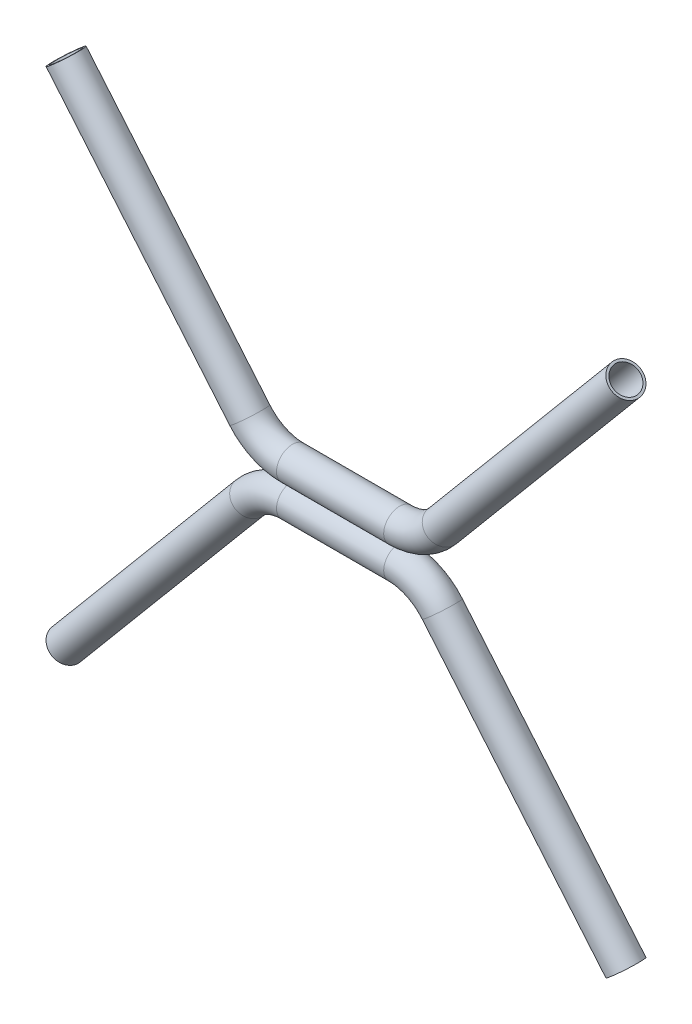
ISO-10303-21;
HEADER;
FILE_DESCRIPTION(('STEP AP214'),'2;1');
FILE_NAME('part.step','',(''),(''),'','','');
FILE_SCHEMA(('AUTOMOTIVE_DESIGN { 1 0 10303 214 1 1 1 1 }'));
ENDSEC;
DATA;
#1=APPLICATION_CONTEXT('core data for automotive mechanical design processes');
#2=APPLICATION_PROTOCOL_DEFINITION('international standard','automotive_design',2000,#1);
#3=PRODUCT_CONTEXT('',#1,'mechanical');
#4=PRODUCT('Part','Part','',(#3));
#5=PRODUCT_RELATED_PRODUCT_CATEGORY('part','',(#4));
#6=PRODUCT_DEFINITION_FORMATION('','',#4);
#7=PRODUCT_DEFINITION_CONTEXT('part definition',#1,'design');
#8=PRODUCT_DEFINITION('design','',#6,#7);
#9=PRODUCT_DEFINITION_SHAPE('','',#8);
#10=(LENGTH_UNIT() NAMED_UNIT(*) SI_UNIT(.MILLI.,.METRE.));
#11=(NAMED_UNIT(*) PLANE_ANGLE_UNIT() SI_UNIT($,.RADIAN.));
#12=(NAMED_UNIT(*) SI_UNIT($,.STERADIAN.) SOLID_ANGLE_UNIT());
#13=UNCERTAINTY_MEASURE_WITH_UNIT(LENGTH_MEASURE(1.E-05),#10,'distance_accuracy_value','');
#14=(GEOMETRIC_REPRESENTATION_CONTEXT(3) GLOBAL_UNCERTAINTY_ASSIGNED_CONTEXT((#13)) GLOBAL_UNIT_ASSIGNED_CONTEXT((#10,
#11,#12)) REPRESENTATION_CONTEXT('',''));
#15=CARTESIAN_POINT('',(0.,0.,0.));
#16=DIRECTION('',(0.,0.,1.));
#17=DIRECTION('',(1.,0.,0.));
#18=AXIS2_PLACEMENT_3D('',#15,#16,#17);
#19=CARTESIAN_POINT('',(33.679231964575,0.,0.));
#20=DIRECTION('',(1.,0.,0.));
#21=DIRECTION('',(0.,1.,0.));
#22=AXIS2_PLACEMENT_3D('',#19,#20,#21);
#23=PLANE('',#22);
#24=CARTESIAN_POINT('',(33.679231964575,10.5353606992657,-3.2311923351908));
#25=DIRECTION('',(0.,-1.,0.));
#26=VECTOR('',#25,1.);
#27=LINE('',#24,#26);
#28=CARTESIAN_POINT('',(33.679231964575,10.5353606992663,-3.23119233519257));
#29=VERTEX_POINT('',#28);
#30=CARTESIAN_POINT('',(33.679231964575,9.4646393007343,-3.2311923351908));
#31=VERTEX_POINT('',#30);
#32=EDGE_CURVE('E104',#29,#31,#27,.T.);
#33=ORIENTED_EDGE('',*,*,#32,.F.);
#34=CARTESIAN_POINT('',(33.679231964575,20.,0.));
#35=DIRECTION('',(1.,0.,0.));
#36=DIRECTION('',(0.,1.,0.));
#37=AXIS2_PLACEMENT_3D('',#34,#35,#36);
#38=CIRCLE('',#37,10.001);
#39=CARTESIAN_POINT('',(33.679231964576,10.,-0.141424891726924));
#40=VERTEX_POINT('',#39);
#41=EDGE_CURVE('E72',#29,#40,#38,.F.);
#42=ORIENTED_EDGE('',*,*,#41,.T.);
#43=CARTESIAN_POINT('',(33.679231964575,0.,0.));
#44=DIRECTION('',(-1.,0.,0.));
#45=DIRECTION('',(0.,-1.,0.));
#46=AXIS2_PLACEMENT_3D('',#43,#44,#45);
#47=CIRCLE('',#46,10.001);
#48=EDGE_CURVE('E97',#31,#40,#47,.F.);
#49=ORIENTED_EDGE('',*,*,#48,.F.);
#50=EDGE_LOOP('',(#33,#42,#49));
#51=FACE_BOUND('',#50,.T.);
#52=ADVANCED_FACE('F47',(#51),#23,.T.);
#53=CARTESIAN_POINT('',(-33.679231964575,20.,0.));
#54=DIRECTION('',(-1.,0.,0.));
#55=DIRECTION('',(0.,-1.,0.));
#56=AXIS2_PLACEMENT_3D('',#53,#54,#55);
#57=PLANE('',#56);
#58=CARTESIAN_POINT('',(-33.679231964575,9.4646393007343,-3.2311923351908));
#59=DIRECTION('',(0.,1.,0.));
#60=VECTOR('',#59,1.);
#61=LINE('',#58,#60);
#62=CARTESIAN_POINT('',(-33.679231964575,9.46463930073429,-3.23119233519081));
#63=VERTEX_POINT('',#62);
#64=CARTESIAN_POINT('',(-33.679231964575,10.5353606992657,-3.2311923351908));
#65=VERTEX_POINT('',#64);
#66=EDGE_CURVE('E92',#63,#65,#61,.T.);
#67=ORIENTED_EDGE('',*,*,#66,.F.);
#68=CARTESIAN_POINT('',(-33.679231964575,0.,0.));
#69=DIRECTION('',(1.,0.,0.));
#70=DIRECTION('',(0.,1.,0.));
#71=AXIS2_PLACEMENT_3D('',#68,#69,#70);
#72=CIRCLE('',#71,10.001);
#73=CARTESIAN_POINT('',(-33.6792319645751,9.99999999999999,-0.141424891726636));
#74=VERTEX_POINT('',#73);
#75=EDGE_CURVE('E64',#63,#74,#72,.T.);
#76=ORIENTED_EDGE('',*,*,#75,.T.);
#77=CARTESIAN_POINT('',(-33.679231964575,20.,0.));
#78=DIRECTION('',(-1.,0.,0.));
#79=DIRECTION('',(0.,-1.,0.));
#80=AXIS2_PLACEMENT_3D('',#77,#78,#79);
#81=CIRCLE('',#80,10.001);
#82=EDGE_CURVE('E85',#65,#74,#81,.T.);
#83=ORIENTED_EDGE('',*,*,#82,.F.);
#84=EDGE_LOOP('',(#67,#76,#83));
#85=FACE_BOUND('',#84,.T.);
#86=ADVANCED_FACE('F49',(#85),#57,.T.);
#87=CARTESIAN_POINT('',(-33.679231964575,10.5353606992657,-3.2311923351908));
#88=DIRECTION('',(0.,0.,-1.));
#89=DIRECTION('',(-1.,0.,0.));
#90=AXIS2_PLACEMENT_3D('',#87,#88,#89);
#91=PLANE('',#90);
#92=ORIENTED_EDGE('',*,*,#32,.T.);
#93=DIRECTION('',(1.,0.,0.));
#94=VECTOR('',#93,1.);
#95=CARTESIAN_POINT('',(-33.679231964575,9.4646393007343,-3.2311923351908));
#96=LINE('',#95,#94);
#97=EDGE_CURVE('E13',#63,#31,#96,.T.);
#98=ORIENTED_EDGE('',*,*,#97,.F.);
#99=ORIENTED_EDGE('',*,*,#66,.T.);
#100=DIRECTION('',(1.,0.,0.));
#101=VECTOR('',#100,1.);
#102=CARTESIAN_POINT('',(-33.679231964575,10.5353606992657,-3.2311923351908));
#103=LINE('',#102,#101);
#104=EDGE_CURVE('E57',#29,#65,#103,.F.);
#105=ORIENTED_EDGE('',*,*,#104,.F.);
#106=EDGE_LOOP('',(#92,#98,#99,#105));
#107=FACE_BOUND('',#106,.T.);
#108=ADVANCED_FACE('F116',(#107),#91,.T.);
#109=CARTESIAN_POINT('',(-33.679231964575,0.,0.));
#110=DIRECTION('',(1.,0.,0.));
#111=DIRECTION('',(0.,1.,0.));
#112=AXIS2_PLACEMENT_3D('',#109,#110,#111);
#113=CYLINDRICAL_SURFACE('',#112,10.001);
#114=ORIENTED_EDGE('',*,*,#48,.T.);
#115=DIRECTION('',(-1.,0.,0.));
#116=VECTOR('',#115,1.);
#117=CARTESIAN_POINT('',(-33.679231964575,10.,-0.141424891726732));
#118=LINE('',#117,#116);
#119=EDGE_CURVE('E87',#40,#74,#118,.T.);
#120=ORIENTED_EDGE('',*,*,#119,.T.);
#121=ORIENTED_EDGE('',*,*,#75,.F.);
#122=ORIENTED_EDGE('',*,*,#97,.T.);
#123=EDGE_LOOP('',(#114,#120,#121,#122));
#124=FACE_BOUND('',#123,.T.);
#125=ADVANCED_FACE('F96',(#124),#113,.F.);
#126=CARTESIAN_POINT('',(-33.679231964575,20.,0.));
#127=DIRECTION('',(1.,0.,0.));
#128=DIRECTION('',(0.,-1.,0.));
#129=AXIS2_PLACEMENT_3D('',#126,#127,#128);
#130=CYLINDRICAL_SURFACE('',#129,10.001);
#131=ORIENTED_EDGE('',*,*,#82,.T.);
#132=ORIENTED_EDGE('',*,*,#119,.F.);
#133=ORIENTED_EDGE('',*,*,#41,.F.);
#134=ORIENTED_EDGE('',*,*,#104,.T.);
#135=EDGE_LOOP('',(#131,#132,#133,#134));
#136=FACE_BOUND('',#135,.T.);
#137=ADVANCED_FACE('F86',(#136),#130,.F.);
#138=CLOSED_SHELL('',(#52,#86,#108,#125,#137));
#139=MANIFOLD_SOLID_BREP('B2',#138);
#140=CARTESIAN_POINT('',(33.679231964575,0.,0.));
#141=DIRECTION('',(1.,0.,0.));
#142=DIRECTION('',(0.,1.,0.));
#143=AXIS2_PLACEMENT_3D('',#140,#141,#142);
#144=PLANE('',#143);
#145=CARTESIAN_POINT('',(33.679231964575,0.,0.));
#146=DIRECTION('',(-1.,0.,0.));
#147=DIRECTION('',(0.,-1.,0.));
#148=AXIS2_PLACEMENT_3D('',#145,#146,#147);
#149=CIRCLE('',#148,10.001);
#150=CARTESIAN_POINT('',(33.6792319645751,9.99999999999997,0.141424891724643));
#151=VERTEX_POINT('',#150);
#152=CARTESIAN_POINT('',(33.679231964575,9.4646393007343,3.2311923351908));
#153=VERTEX_POINT('',#152);
#154=EDGE_CURVE('E260',#151,#153,#149,.F.);
#155=ORIENTED_EDGE('',*,*,#154,.F.);
#156=CARTESIAN_POINT('',(33.679231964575,20.,0.));
#157=DIRECTION('',(1.,0.,0.));
#158=DIRECTION('',(0.,1.,0.));
#159=AXIS2_PLACEMENT_3D('',#156,#157,#158);
#160=CIRCLE('',#159,10.001);
#161=CARTESIAN_POINT('',(33.679231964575,10.5353606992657,3.2311923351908));
#162=VERTEX_POINT('',#161);
#163=EDGE_CURVE('E45',#151,#162,#160,.F.);
#164=ORIENTED_EDGE('',*,*,#163,.T.);
#165=CARTESIAN_POINT('',(33.679231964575,10.5353606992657,3.2311923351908));
#166=DIRECTION('',(0.,-1.,0.));
#167=VECTOR('',#166,1.);
#168=LINE('',#165,#167);
#169=EDGE_CURVE('E232',#162,#153,#168,.T.);
#170=ORIENTED_EDGE('',*,*,#169,.T.);
#171=EDGE_LOOP('',(#155,#164,#170));
#172=FACE_BOUND('',#171,.T.);
#173=ADVANCED_FACE('F208',(#172),#144,.T.);
#174=CARTESIAN_POINT('',(-33.679231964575,0.,0.));
#175=DIRECTION('',(1.,0.,0.));
#176=DIRECTION('',(0.,1.,0.));
#177=AXIS2_PLACEMENT_3D('',#174,#175,#176);
#178=PLANE('',#177);
#179=CARTESIAN_POINT('',(-33.679231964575,0.,0.));
#180=DIRECTION('',(1.,0.,0.));
#181=DIRECTION('',(0.,1.,0.));
#182=AXIS2_PLACEMENT_3D('',#179,#180,#181);
#183=CIRCLE('',#182,10.001);
#184=CARTESIAN_POINT('',(-33.679231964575,10.,0.141424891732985));
#185=VERTEX_POINT('',#184);
#186=CARTESIAN_POINT('',(-33.679231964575,9.46463930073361,3.2311923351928));
#187=VERTEX_POINT('',#186);
#188=EDGE_CURVE('E218',#185,#187,#183,.T.);
#189=ORIENTED_EDGE('',*,*,#188,.T.);
#190=CARTESIAN_POINT('',(-33.679231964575,9.46463930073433,3.2311923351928));
#191=DIRECTION('',(0.,1.,0.));
#192=VECTOR('',#191,1.);
#193=LINE('',#190,#192);
#194=CARTESIAN_POINT('',(-33.679231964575,10.5353606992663,3.23119233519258));
#195=VERTEX_POINT('',#194);
#196=EDGE_CURVE('E250',#187,#195,#193,.T.);
#197=ORIENTED_EDGE('',*,*,#196,.T.);
#198=CARTESIAN_POINT('',(-33.679231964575,20.,0.));
#199=DIRECTION('',(-1.,0.,0.));
#200=DIRECTION('',(0.,-1.,0.));
#201=AXIS2_PLACEMENT_3D('',#198,#199,#200);
#202=CIRCLE('',#201,10.001);
#203=EDGE_CURVE('E246',#185,#195,#202,.T.);
#204=ORIENTED_EDGE('',*,*,#203,.F.);
#205=EDGE_LOOP('',(#189,#197,#204));
#206=FACE_BOUND('',#205,.T.);
#207=ADVANCED_FACE('F248',(#206),#178,.F.);
#208=CARTESIAN_POINT('',(-33.679231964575,10.5353606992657,3.2311923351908));
#209=DIRECTION('',(0.,0.,1.));
#210=DIRECTION('',(1.,0.,0.));
#211=AXIS2_PLACEMENT_3D('',#208,#209,#210);
#212=PLANE('',#211);
#213=ORIENTED_EDGE('',*,*,#196,.F.);
#214=DIRECTION('',(1.,0.,0.));
#215=VECTOR('',#214,1.);
#216=CARTESIAN_POINT('',(-33.679231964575,9.4646393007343,3.2311923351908));
#217=LINE('',#216,#215);
#218=EDGE_CURVE('E257',#153,#187,#217,.F.);
#219=ORIENTED_EDGE('',*,*,#218,.F.);
#220=ORIENTED_EDGE('',*,*,#169,.F.);
#221=DIRECTION('',(1.,0.,0.));
#222=VECTOR('',#221,1.);
#223=CARTESIAN_POINT('',(-33.679231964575,10.5353606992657,3.2311923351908));
#224=LINE('',#223,#222);
#225=EDGE_CURVE('E262',#195,#162,#224,.T.);
#226=ORIENTED_EDGE('',*,*,#225,.F.);
#227=EDGE_LOOP('',(#213,#219,#220,#226));
#228=FACE_BOUND('',#227,.T.);
#229=ADVANCED_FACE('F283',(#228),#212,.T.);
#230=CARTESIAN_POINT('',(-33.679231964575,0.,0.));
#231=DIRECTION('',(1.,0.,0.));
#232=DIRECTION('',(0.,1.,0.));
#233=AXIS2_PLACEMENT_3D('',#230,#231,#232);
#234=CYLINDRICAL_SURFACE('',#233,10.001);
#235=ORIENTED_EDGE('',*,*,#188,.F.);
#236=DIRECTION('',(1.,0.,0.));
#237=VECTOR('',#236,1.);
#238=CARTESIAN_POINT('',(-33.679231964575,10.,0.141424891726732));
#239=LINE('',#238,#237);
#240=EDGE_CURVE('E251',#185,#151,#239,.T.);
#241=ORIENTED_EDGE('',*,*,#240,.T.);
#242=ORIENTED_EDGE('',*,*,#154,.T.);
#243=ORIENTED_EDGE('',*,*,#218,.T.);
#244=EDGE_LOOP('',(#235,#241,#242,#243));
#245=FACE_BOUND('',#244,.T.);
#246=ADVANCED_FACE('F255',(#245),#234,.F.);
#247=CARTESIAN_POINT('',(-33.679231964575,20.,0.));
#248=DIRECTION('',(1.,0.,0.));
#249=DIRECTION('',(0.,-1.,0.));
#250=AXIS2_PLACEMENT_3D('',#247,#248,#249);
#251=CYLINDRICAL_SURFACE('',#250,10.001);
#252=ORIENTED_EDGE('',*,*,#163,.F.);
#253=ORIENTED_EDGE('',*,*,#240,.F.);
#254=ORIENTED_EDGE('',*,*,#203,.T.);
#255=ORIENTED_EDGE('',*,*,#225,.T.);
#256=EDGE_LOOP('',(#252,#253,#254,#255));
#257=FACE_BOUND('',#256,.T.);
#258=ADVANCED_FACE('F259',(#257),#251,.F.);
#259=CLOSED_SHELL('',(#173,#207,#229,#246,#258));
#260=MANIFOLD_SOLID_BREP('B7',#259);
#261=CARTESIAN_POINT('',(-60.4907874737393,32.5024336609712,0.));
#262=DIRECTION('',(-0.642787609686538,0.766044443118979,0.));
#263=DIRECTION('',(0.766044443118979,0.642787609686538,0.));
#264=AXIS2_PLACEMENT_3D('',#261,#262,#263);
#265=CYLINDRICAL_SURFACE('',#264,10.);
#266=CARTESIAN_POINT('',(-60.4907874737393,32.5024336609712,0.));
#267=DIRECTION('',(-0.642787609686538,0.766044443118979,0.));
#268=DIRECTION('',(0.,0.,-1.));
#269=AXIS2_PLACEMENT_3D('',#266,#267,#268);
#270=CIRCLE('',#269,10.);
#271=CARTESIAN_POINT('',(-68.1512319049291,26.0745575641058,0.));
#272=VERTEX_POINT('',#271);
#273=EDGE_CURVE('E378',#272,#272,#270,.T.);
#274=ORIENTED_EDGE('',*,*,#273,.T.);
#275=EDGE_LOOP('',(#274));
#276=FACE_BOUND('',#275,.T.);
#277=CARTESIAN_POINT('',(-175.864944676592,170.,0.));
#278=DIRECTION('',(-0.642787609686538,0.766044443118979,0.));
#279=DIRECTION('',(0.,0.,-1.));
#280=AXIS2_PLACEMENT_3D('',#277,#278,#279);
#281=CIRCLE('',#280,10.);
#282=CARTESIAN_POINT('',(-175.864944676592,170.,-10.));
#283=VERTEX_POINT('',#282);
#284=EDGE_CURVE('E207',#283,#283,#281,.T.);
#285=ORIENTED_EDGE('',*,*,#284,.F.);
#286=EDGE_LOOP('',(#285));
#287=FACE_BOUND('',#286,.T.);
#288=ADVANCED_FACE('F368',(#276,#287),#265,.T.);
#289=CARTESIAN_POINT('',(-60.4907874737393,32.5024336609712,0.));
#290=DIRECTION('',(-0.642787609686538,0.766044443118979,0.));
#291=DIRECTION('',(0.766044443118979,0.642787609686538,0.));
#292=AXIS2_PLACEMENT_3D('',#289,#290,#291);
#293=CYLINDRICAL_SURFACE('',#292,8.5);
#294=CARTESIAN_POINT('',(-60.4907874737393,32.5024336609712,0.));
#295=DIRECTION('',(-0.642787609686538,0.766044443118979,0.));
#296=DIRECTION('',(0.,0.,-1.));
#297=AXIS2_PLACEMENT_3D('',#294,#295,#296);
#298=CIRCLE('',#297,8.5);
#299=CARTESIAN_POINT('',(-67.0021652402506,27.0387389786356,0.));
#300=VERTEX_POINT('',#299);
#301=EDGE_CURVE('E382',#300,#300,#298,.T.);
#302=ORIENTED_EDGE('',*,*,#301,.F.);
#303=EDGE_LOOP('',(#302));
#304=FACE_BOUND('',#303,.T.);
#305=CARTESIAN_POINT('',(-175.864944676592,170.,0.));
#306=DIRECTION('',(-0.642787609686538,0.766044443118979,0.));
#307=DIRECTION('',(0.,0.,-1.));
#308=AXIS2_PLACEMENT_3D('',#305,#306,#307);
#309=CIRCLE('',#308,8.5);
#310=CARTESIAN_POINT('',(-175.864944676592,170.,-8.5));
#311=VERTEX_POINT('',#310);
#312=EDGE_CURVE('E374',#311,#311,#309,.T.);
#313=ORIENTED_EDGE('',*,*,#312,.T.);
#314=EDGE_LOOP('',(#313));
#315=FACE_BOUND('',#314,.T.);
#316=ADVANCED_FACE('F432',(#304,#315),#293,.F.);
#317=CARTESIAN_POINT('',(-33.679231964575,55.,0.));
#318=DIRECTION('',(0.,0.,1.));
#319=DIRECTION('',(1.,0.,0.));
#320=AXIS2_PLACEMENT_3D('',#317,#318,#319);
#321=TOROIDAL_SURFACE('',#320,35.,10.);
#322=CARTESIAN_POINT('',(-33.679231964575,20.,0.));
#323=DIRECTION('',(-1.,0.,0.));
#324=DIRECTION('',(0.,0.,-1.));
#325=AXIS2_PLACEMENT_3D('',#322,#323,#324);
#326=CIRCLE('',#325,10.);
#327=CARTESIAN_POINT('',(-33.679231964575,9.99999999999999,0.));
#328=VERTEX_POINT('',#327);
#329=EDGE_CURVE('E387',#328,#328,#326,.T.);
#330=CARTESIAN_POINT('',(-33.679231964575,55.,0.));
#331=DIRECTION('',(0.,0.,1.));
#332=DIRECTION('',(1.,0.,0.));
#333=AXIS2_PLACEMENT_3D('',#330,#331,#332);
#334=CIRCLE('',#333,45.);
#335=EDGE_CURVE('',#272,#328,#334,.T.);
#336=ORIENTED_EDGE('',*,*,#273,.F.);
#337=ORIENTED_EDGE('',*,*,#329,.T.);
#338=ORIENTED_EDGE('',*,*,#335,.T.);
#339=ORIENTED_EDGE('',*,*,#335,.F.);
#340=EDGE_LOOP('',(#336,#338,#337,#339));
#341=FACE_BOUND('',#340,.T.);
#342=ADVANCED_FACE('F428',(#341),#321,.T.);
#343=CARTESIAN_POINT('',(-33.679231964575,55.,0.));
#344=DIRECTION('',(0.,0.,1.));
#345=DIRECTION('',(1.,0.,0.));
#346=AXIS2_PLACEMENT_3D('',#343,#344,#345);
#347=TOROIDAL_SURFACE('',#346,35.,8.5);
#348=CARTESIAN_POINT('',(-33.679231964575,20.,0.));
#349=DIRECTION('',(-1.,0.,0.));
#350=DIRECTION('',(0.,0.,-1.));
#351=AXIS2_PLACEMENT_3D('',#348,#349,#350);
#352=CIRCLE('',#351,8.5);
#353=CARTESIAN_POINT('',(-33.679231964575,11.5,0.));
#354=VERTEX_POINT('',#353);
#355=EDGE_CURVE('E390',#354,#354,#352,.T.);
#356=CARTESIAN_POINT('',(-33.679231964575,55.,0.));
#357=DIRECTION('',(0.,0.,1.));
#358=DIRECTION('',(1.,0.,0.));
#359=AXIS2_PLACEMENT_3D('',#356,#357,#358);
#360=CIRCLE('',#359,43.5);
#361=EDGE_CURVE('',#300,#354,#360,.T.);
#362=ORIENTED_EDGE('',*,*,#301,.T.);
#363=ORIENTED_EDGE('',*,*,#355,.F.);
#364=ORIENTED_EDGE('',*,*,#361,.T.);
#365=ORIENTED_EDGE('',*,*,#361,.F.);
#366=EDGE_LOOP('',(#362,#364,#363,#365));
#367=FACE_BOUND('',#366,.T.);
#368=ADVANCED_FACE('F418',(#367),#347,.F.);
#369=CARTESIAN_POINT('',(-33.679231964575,20.,0.));
#370=DIRECTION('',(1.,0.,0.));
#371=DIRECTION('',(0.,-1.,0.));
#372=AXIS2_PLACEMENT_3D('',#369,#370,#371);
#373=CYLINDRICAL_SURFACE('',#372,8.5);
#374=ORIENTED_EDGE('',*,*,#355,.T.);
#375=EDGE_LOOP('',(#374));
#376=FACE_BOUND('',#375,.T.);
#377=CARTESIAN_POINT('',(33.679231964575,20.,0.));
#378=DIRECTION('',(-1.,0.,0.));
#379=DIRECTION('',(0.,0.,-1.));
#380=AXIS2_PLACEMENT_3D('',#377,#378,#379);
#381=CIRCLE('',#380,8.5);
#382=CARTESIAN_POINT('',(33.679231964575,11.5,0.));
#383=VERTEX_POINT('',#382);
#384=EDGE_CURVE('E408',#383,#383,#381,.T.);
#385=ORIENTED_EDGE('',*,*,#384,.F.);
#386=EDGE_LOOP('',(#385));
#387=FACE_BOUND('',#386,.T.);
#388=ADVANCED_FACE('F415',(#376,#387),#373,.F.);
#389=CARTESIAN_POINT('',(-33.679231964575,20.,0.));
#390=DIRECTION('',(1.,0.,0.));
#391=DIRECTION('',(0.,-1.,0.));
#392=AXIS2_PLACEMENT_3D('',#389,#390,#391);
#393=CYLINDRICAL_SURFACE('',#392,10.);
#394=ORIENTED_EDGE('',*,*,#329,.F.);
#395=EDGE_LOOP('',(#394));
#396=FACE_BOUND('',#395,.T.);
#397=CARTESIAN_POINT('',(33.679231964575,20.,0.));
#398=DIRECTION('',(-1.,0.,0.));
#399=DIRECTION('',(0.,0.,-1.));
#400=AXIS2_PLACEMENT_3D('',#397,#398,#399);
#401=CIRCLE('',#400,10.);
#402=CARTESIAN_POINT('',(33.679231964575,9.99999999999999,0.));
#403=VERTEX_POINT('',#402);
#404=EDGE_CURVE('E405',#403,#403,#401,.T.);
#405=ORIENTED_EDGE('',*,*,#404,.T.);
#406=EDGE_LOOP('',(#405));
#407=FACE_BOUND('',#406,.T.);
#408=ADVANCED_FACE('F417',(#396,#407),#393,.T.);
#409=CARTESIAN_POINT('',(-175.864944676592,170.,0.));
#410=DIRECTION('',(0.642787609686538,-0.766044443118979,0.));
#411=DIRECTION('',(0.,0.,-1.));
#412=AXIS2_PLACEMENT_3D('',#409,#410,#411);
#413=PLANE('',#412);
#414=ORIENTED_EDGE('',*,*,#312,.F.);
#415=EDGE_LOOP('',(#414));
#416=FACE_BOUND('',#415,.T.);
#417=ORIENTED_EDGE('',*,*,#284,.T.);
#418=EDGE_LOOP('',(#417));
#419=FACE_BOUND('',#418,.T.);
#420=ADVANCED_FACE('F425',(#416,#419),#413,.F.);
#421=CARTESIAN_POINT('',(60.4907874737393,32.5024336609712,0.));
#422=DIRECTION('',(0.642787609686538,0.766044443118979,0.));
#423=DIRECTION('',(0.766044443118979,-0.642787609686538,0.));
#424=AXIS2_PLACEMENT_3D('',#421,#422,#423);
#425=CYLINDRICAL_SURFACE('',#424,10.);
#426=CARTESIAN_POINT('',(60.4907874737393,32.5024336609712,0.));
#427=DIRECTION('',(-0.642787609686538,-0.766044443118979,0.));
#428=DIRECTION('',(0.,0.,-1.));
#429=AXIS2_PLACEMENT_3D('',#426,#427,#428);
#430=CIRCLE('',#429,10.);
#431=CARTESIAN_POINT('',(68.1512319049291,26.0745575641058,0.));
#432=VERTEX_POINT('',#431);
#433=EDGE_CURVE('E399',#432,#432,#430,.T.);
#434=ORIENTED_EDGE('',*,*,#433,.F.);
#435=EDGE_LOOP('',(#434));
#436=FACE_BOUND('',#435,.T.);
#437=CARTESIAN_POINT('',(175.864944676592,170.,0.));
#438=DIRECTION('',(-0.642787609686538,-0.766044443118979,0.));
#439=DIRECTION('',(0.,0.,-1.));
#440=AXIS2_PLACEMENT_3D('',#437,#438,#439);
#441=CIRCLE('',#440,10.);
#442=CARTESIAN_POINT('',(175.864944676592,170.,-10.));
#443=VERTEX_POINT('',#442);
#444=EDGE_CURVE('E393',#443,#443,#441,.T.);
#445=ORIENTED_EDGE('',*,*,#444,.T.);
#446=EDGE_LOOP('',(#445));
#447=FACE_BOUND('',#446,.T.);
#448=ADVANCED_FACE('F457',(#436,#447),#425,.T.);
#449=CARTESIAN_POINT('',(60.4907874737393,32.5024336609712,0.));
#450=DIRECTION('',(0.642787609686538,0.766044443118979,0.));
#451=DIRECTION('',(0.766044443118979,-0.642787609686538,0.));
#452=AXIS2_PLACEMENT_3D('',#449,#450,#451);
#453=CYLINDRICAL_SURFACE('',#452,8.5);
#454=CARTESIAN_POINT('',(60.4907874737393,32.5024336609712,0.));
#455=DIRECTION('',(-0.642787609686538,-0.766044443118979,0.));
#456=DIRECTION('',(0.,0.,-1.));
#457=AXIS2_PLACEMENT_3D('',#454,#455,#456);
#458=CIRCLE('',#457,8.5);
#459=CARTESIAN_POINT('',(67.0021652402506,27.0387389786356,0.));
#460=VERTEX_POINT('',#459);
#461=EDGE_CURVE('E402',#460,#460,#458,.T.);
#462=ORIENTED_EDGE('',*,*,#461,.T.);
#463=EDGE_LOOP('',(#462));
#464=FACE_BOUND('',#463,.T.);
#465=CARTESIAN_POINT('',(175.864944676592,170.,0.));
#466=DIRECTION('',(-0.642787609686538,-0.766044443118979,0.));
#467=DIRECTION('',(0.,0.,-1.));
#468=AXIS2_PLACEMENT_3D('',#465,#466,#467);
#469=CIRCLE('',#468,8.5);
#470=CARTESIAN_POINT('',(175.864944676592,170.,-8.5));
#471=VERTEX_POINT('',#470);
#472=EDGE_CURVE('E396',#471,#471,#469,.T.);
#473=ORIENTED_EDGE('',*,*,#472,.F.);
#474=EDGE_LOOP('',(#473));
#475=FACE_BOUND('',#474,.T.);
#476=ADVANCED_FACE('F453',(#464,#475),#453,.F.);
#477=CARTESIAN_POINT('',(33.679231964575,55.,0.));
#478=DIRECTION('',(0.,0.,-1.));
#479=DIRECTION('',(-1.,0.,0.));
#480=AXIS2_PLACEMENT_3D('',#477,#478,#479);
#481=TOROIDAL_SURFACE('',#480,35.,10.);
#482=CARTESIAN_POINT('',(33.679231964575,55.,0.));
#483=DIRECTION('',(0.,0.,-1.));
#484=DIRECTION('',(-1.,0.,0.));
#485=AXIS2_PLACEMENT_3D('',#482,#483,#484);
#486=CIRCLE('',#485,45.);
#487=EDGE_CURVE('',#432,#403,#486,.T.);
#488=ORIENTED_EDGE('',*,*,#433,.T.);
#489=ORIENTED_EDGE('',*,*,#404,.F.);
#490=ORIENTED_EDGE('',*,*,#487,.T.);
#491=ORIENTED_EDGE('',*,*,#487,.F.);
#492=EDGE_LOOP('',(#488,#490,#489,#491));
#493=FACE_BOUND('',#492,.T.);
#494=ADVANCED_FACE('F450',(#493),#481,.T.);
#495=CARTESIAN_POINT('',(33.679231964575,55.,0.));
#496=DIRECTION('',(0.,0.,-1.));
#497=DIRECTION('',(-1.,0.,0.));
#498=AXIS2_PLACEMENT_3D('',#495,#496,#497);
#499=TOROIDAL_SURFACE('',#498,35.,8.5);
#500=CARTESIAN_POINT('',(33.679231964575,55.,0.));
#501=DIRECTION('',(0.,0.,-1.));
#502=DIRECTION('',(-1.,0.,0.));
#503=AXIS2_PLACEMENT_3D('',#500,#501,#502);
#504=CIRCLE('',#503,43.5);
#505=EDGE_CURVE('',#460,#383,#504,.T.);
#506=ORIENTED_EDGE('',*,*,#461,.F.);
#507=ORIENTED_EDGE('',*,*,#384,.T.);
#508=ORIENTED_EDGE('',*,*,#505,.T.);
#509=ORIENTED_EDGE('',*,*,#505,.F.);
#510=EDGE_LOOP('',(#506,#508,#507,#509));
#511=FACE_BOUND('',#510,.T.);
#512=ADVANCED_FACE('F412',(#511),#499,.F.);
#513=CARTESIAN_POINT('',(175.864944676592,170.,0.));
#514=DIRECTION('',(-0.642787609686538,-0.766044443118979,0.));
#515=DIRECTION('',(0.,0.,-1.));
#516=AXIS2_PLACEMENT_3D('',#513,#514,#515);
#517=PLANE('',#516);
#518=ORIENTED_EDGE('',*,*,#472,.T.);
#519=EDGE_LOOP('',(#518));
#520=FACE_BOUND('',#519,.T.);
#521=ORIENTED_EDGE('',*,*,#444,.F.);
#522=EDGE_LOOP('',(#521));
#523=FACE_BOUND('',#522,.T.);
#524=ADVANCED_FACE('F463',(#520,#523),#517,.F.);
#525=CLOSED_SHELL('',(#288,#316,#342,#368,#388,#408,#420,#448,#476,#494,#512,#524));
#526=MANIFOLD_SOLID_BREP('B39',#525);
#527=CARTESIAN_POINT('',(-60.4907874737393,-12.5024336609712,0.));
#528=DIRECTION('',(-0.642787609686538,-0.766044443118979,0.));
#529=DIRECTION('',(0.766044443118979,-0.642787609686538,0.));
#530=AXIS2_PLACEMENT_3D('',#527,#528,#529);
#531=CYLINDRICAL_SURFACE('',#530,10.);
#532=CARTESIAN_POINT('',(-60.4907874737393,-12.5024336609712,0.));
#533=DIRECTION('',(0.642787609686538,0.766044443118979,0.));
#534=DIRECTION('',(0.,0.,-1.));
#535=AXIS2_PLACEMENT_3D('',#532,#533,#534);
#536=CIRCLE('',#535,10.);
#537=CARTESIAN_POINT('',(-68.1512319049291,-6.07455756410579,0.));
#538=VERTEX_POINT('',#537);
#539=EDGE_CURVE('E565',#538,#538,#536,.T.);
#540=ORIENTED_EDGE('',*,*,#539,.F.);
#541=EDGE_LOOP('',(#540));
#542=FACE_BOUND('',#541,.T.);
#543=CARTESIAN_POINT('',(-175.864944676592,-150.,0.));
#544=DIRECTION('',(0.642787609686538,0.766044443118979,0.));
#545=DIRECTION('',(0.,0.,-1.));
#546=AXIS2_PLACEMENT_3D('',#543,#544,#545);
#547=CIRCLE('',#546,10.);
#548=CARTESIAN_POINT('',(-175.864944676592,-150.,-10.));
#549=VERTEX_POINT('',#548);
#550=EDGE_CURVE('E367',#549,#549,#547,.T.);
#551=ORIENTED_EDGE('',*,*,#550,.T.);
#552=EDGE_LOOP('',(#551));
#553=FACE_BOUND('',#552,.T.);
#554=ADVANCED_FACE('F555',(#542,#553),#531,.T.);
#555=CARTESIAN_POINT('',(-60.4907874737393,-12.5024336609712,0.));
#556=DIRECTION('',(-0.642787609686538,-0.766044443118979,0.));
#557=DIRECTION('',(0.766044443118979,-0.642787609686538,0.));
#558=AXIS2_PLACEMENT_3D('',#555,#556,#557);
#559=CYLINDRICAL_SURFACE('',#558,8.5);
#560=CARTESIAN_POINT('',(-60.4907874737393,-12.5024336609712,0.));
#561=DIRECTION('',(0.642787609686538,0.766044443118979,0.));
#562=DIRECTION('',(0.,0.,-1.));
#563=AXIS2_PLACEMENT_3D('',#560,#561,#562);
#564=CIRCLE('',#563,8.5);
#565=CARTESIAN_POINT('',(-67.0021652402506,-7.0387389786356,0.));
#566=VERTEX_POINT('',#565);
#567=EDGE_CURVE('E569',#566,#566,#564,.T.);
#568=ORIENTED_EDGE('',*,*,#567,.T.);
#569=EDGE_LOOP('',(#568));
#570=FACE_BOUND('',#569,.T.);
#571=CARTESIAN_POINT('',(-175.864944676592,-150.,0.));
#572=DIRECTION('',(0.642787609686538,0.766044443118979,0.));
#573=DIRECTION('',(0.,0.,-1.));
#574=AXIS2_PLACEMENT_3D('',#571,#572,#573);
#575=CIRCLE('',#574,8.5);
#576=CARTESIAN_POINT('',(-175.864944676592,-150.,-8.5));
#577=VERTEX_POINT('',#576);
#578=EDGE_CURVE('E561',#577,#577,#575,.T.);
#579=ORIENTED_EDGE('',*,*,#578,.F.);
#580=EDGE_LOOP('',(#579));
#581=FACE_BOUND('',#580,.T.);
#582=ADVANCED_FACE('F631',(#570,#581),#559,.F.);
#583=CARTESIAN_POINT('',(-33.679231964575,-35.,0.));
#584=DIRECTION('',(0.,0.,1.));
#585=DIRECTION('',(1.,0.,0.));
#586=AXIS2_PLACEMENT_3D('',#583,#584,#585);
#587=TOROIDAL_SURFACE('',#586,35.,10.);
#588=CARTESIAN_POINT('',(-33.679231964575,0.,0.));
#589=DIRECTION('',(1.,0.,0.));
#590=DIRECTION('',(0.,0.,-1.));
#591=AXIS2_PLACEMENT_3D('',#588,#589,#590);
#592=CIRCLE('',#591,10.);
#593=CARTESIAN_POINT('',(-33.679231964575,10.,0.));
#594=VERTEX_POINT('',#593);
#595=EDGE_CURVE('E574',#594,#594,#592,.T.);
#596=CARTESIAN_POINT('',(-33.679231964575,-35.,0.));
#597=DIRECTION('',(0.,0.,1.));
#598=DIRECTION('',(1.,0.,0.));
#599=AXIS2_PLACEMENT_3D('',#596,#597,#598);
#600=CIRCLE('',#599,45.);
#601=EDGE_CURVE('',#594,#538,#600,.T.);
#602=ORIENTED_EDGE('',*,*,#595,.F.);
#603=ORIENTED_EDGE('',*,*,#539,.T.);
#604=ORIENTED_EDGE('',*,*,#601,.T.);
#605=ORIENTED_EDGE('',*,*,#601,.F.);
#606=EDGE_LOOP('',(#602,#604,#603,#605));
#607=FACE_BOUND('',#606,.T.);
#608=ADVANCED_FACE('F636',(#607),#587,.T.);
#609=CARTESIAN_POINT('',(-33.679231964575,-35.,0.));
#610=DIRECTION('',(0.,0.,1.));
#611=DIRECTION('',(1.,0.,0.));
#612=AXIS2_PLACEMENT_3D('',#609,#610,#611);
#613=TOROIDAL_SURFACE('',#612,35.,8.5);
#614=CARTESIAN_POINT('',(-33.679231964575,0.,0.));
#615=DIRECTION('',(1.,0.,0.));
#616=DIRECTION('',(0.,0.,-1.));
#617=AXIS2_PLACEMENT_3D('',#614,#615,#616);
#618=CIRCLE('',#617,8.5);
#619=CARTESIAN_POINT('',(-33.679231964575,8.5,0.));
#620=VERTEX_POINT('',#619);
#621=EDGE_CURVE('E577',#620,#620,#618,.T.);
#622=CARTESIAN_POINT('',(-33.679231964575,-35.,0.));
#623=DIRECTION('',(0.,0.,1.));
#624=DIRECTION('',(1.,0.,0.));
#625=AXIS2_PLACEMENT_3D('',#622,#623,#624);
#626=CIRCLE('',#625,43.5);
#627=EDGE_CURVE('',#620,#566,#626,.T.);
#628=ORIENTED_EDGE('',*,*,#621,.T.);
#629=ORIENTED_EDGE('',*,*,#567,.F.);
#630=ORIENTED_EDGE('',*,*,#627,.T.);
#631=ORIENTED_EDGE('',*,*,#627,.F.);
#632=EDGE_LOOP('',(#628,#630,#629,#631));
#633=FACE_BOUND('',#632,.T.);
#634=ADVANCED_FACE('F641',(#633),#613,.F.);
#635=CARTESIAN_POINT('',(-33.679231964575,0.,0.));
#636=DIRECTION('',(1.,0.,0.));
#637=DIRECTION('',(0.,1.,0.));
#638=AXIS2_PLACEMENT_3D('',#635,#636,#637);
#639=CYLINDRICAL_SURFACE('',#638,8.5);
#640=ORIENTED_EDGE('',*,*,#621,.F.);
#641=EDGE_LOOP('',(#640));
#642=FACE_BOUND('',#641,.T.);
#643=CARTESIAN_POINT('',(33.679231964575,0.,0.));
#644=DIRECTION('',(1.,0.,0.));
#645=DIRECTION('',(0.,0.,-1.));
#646=AXIS2_PLACEMENT_3D('',#643,#644,#645);
#647=CIRCLE('',#646,8.5);
#648=CARTESIAN_POINT('',(33.679231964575,8.5,0.));
#649=VERTEX_POINT('',#648);
#650=EDGE_CURVE('E595',#649,#649,#647,.T.);
#651=ORIENTED_EDGE('',*,*,#650,.T.);
#652=EDGE_LOOP('',(#651));
#653=FACE_BOUND('',#652,.T.);
#654=ADVANCED_FACE('F599',(#642,#653),#639,.F.);
#655=CARTESIAN_POINT('',(-33.679231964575,0.,0.));
#656=DIRECTION('',(1.,0.,0.));
#657=DIRECTION('',(0.,1.,0.));
#658=AXIS2_PLACEMENT_3D('',#655,#656,#657);
#659=CYLINDRICAL_SURFACE('',#658,10.);
#660=ORIENTED_EDGE('',*,*,#595,.T.);
#661=EDGE_LOOP('',(#660));
#662=FACE_BOUND('',#661,.T.);
#663=CARTESIAN_POINT('',(33.679231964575,0.,0.));
#664=DIRECTION('',(1.,0.,0.));
#665=DIRECTION('',(0.,0.,-1.));
#666=AXIS2_PLACEMENT_3D('',#663,#664,#665);
#667=CIRCLE('',#666,10.);
#668=CARTESIAN_POINT('',(33.679231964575,10.,0.));
#669=VERTEX_POINT('',#668);
#670=EDGE_CURVE('E592',#669,#669,#667,.T.);
#671=ORIENTED_EDGE('',*,*,#670,.F.);
#672=EDGE_LOOP('',(#671));
#673=FACE_BOUND('',#672,.T.);
#674=ADVANCED_FACE('F628',(#662,#673),#659,.T.);
#675=CARTESIAN_POINT('',(-175.864944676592,-150.,0.));
#676=DIRECTION('',(0.642787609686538,0.766044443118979,0.));
#677=DIRECTION('',(0.,0.,-1.));
#678=AXIS2_PLACEMENT_3D('',#675,#676,#677);
#679=PLANE('',#678);
#680=ORIENTED_EDGE('',*,*,#578,.T.);
#681=EDGE_LOOP('',(#680));
#682=FACE_BOUND('',#681,.T.);
#683=ORIENTED_EDGE('',*,*,#550,.F.);
#684=EDGE_LOOP('',(#683));
#685=FACE_BOUND('',#684,.T.);
#686=ADVANCED_FACE('F622',(#682,#685),#679,.F.);
#687=CARTESIAN_POINT('',(60.4907874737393,-12.5024336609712,0.));
#688=DIRECTION('',(0.642787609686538,-0.766044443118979,0.));
#689=DIRECTION('',(0.766044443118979,0.642787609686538,0.));
#690=AXIS2_PLACEMENT_3D('',#687,#688,#689);
#691=CYLINDRICAL_SURFACE('',#690,10.);
#692=CARTESIAN_POINT('',(60.4907874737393,-12.5024336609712,0.));
#693=DIRECTION('',(0.642787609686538,-0.766044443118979,0.));
#694=DIRECTION('',(0.,0.,-1.));
#695=AXIS2_PLACEMENT_3D('',#692,#693,#694);
#696=CIRCLE('',#695,10.);
#697=CARTESIAN_POINT('',(68.1512319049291,-6.07455756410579,0.));
#698=VERTEX_POINT('',#697);
#699=EDGE_CURVE('E586',#698,#698,#696,.T.);
#700=ORIENTED_EDGE('',*,*,#699,.T.);
#701=EDGE_LOOP('',(#700));
#702=FACE_BOUND('',#701,.T.);
#703=CARTESIAN_POINT('',(175.864944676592,-150.,0.));
#704=DIRECTION('',(0.642787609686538,-0.766044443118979,0.));
#705=DIRECTION('',(0.,0.,-1.));
#706=AXIS2_PLACEMENT_3D('',#703,#704,#705);
#707=CIRCLE('',#706,10.);
#708=CARTESIAN_POINT('',(175.864944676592,-150.,-10.));
#709=VERTEX_POINT('',#708);
#710=EDGE_CURVE('E580',#709,#709,#707,.T.);
#711=ORIENTED_EDGE('',*,*,#710,.F.);
#712=EDGE_LOOP('',(#711));
#713=FACE_BOUND('',#712,.T.);
#714=ADVANCED_FACE('F612',(#702,#713),#691,.T.);
#715=CARTESIAN_POINT('',(60.4907874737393,-12.5024336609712,0.));
#716=DIRECTION('',(0.642787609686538,-0.766044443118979,0.));
#717=DIRECTION('',(0.766044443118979,0.642787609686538,0.));
#718=AXIS2_PLACEMENT_3D('',#715,#716,#717);
#719=CYLINDRICAL_SURFACE('',#718,8.5);
#720=CARTESIAN_POINT('',(60.4907874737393,-12.5024336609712,0.));
#721=DIRECTION('',(0.642787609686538,-0.766044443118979,0.));
#722=DIRECTION('',(0.,0.,-1.));
#723=AXIS2_PLACEMENT_3D('',#720,#721,#722);
#724=CIRCLE('',#723,8.5);
#725=CARTESIAN_POINT('',(67.0021652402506,-7.0387389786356,0.));
#726=VERTEX_POINT('',#725);
#727=EDGE_CURVE('E589',#726,#726,#724,.T.);
#728=ORIENTED_EDGE('',*,*,#727,.F.);
#729=EDGE_LOOP('',(#728));
#730=FACE_BOUND('',#729,.T.);
#731=CARTESIAN_POINT('',(175.864944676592,-150.,0.));
#732=DIRECTION('',(0.642787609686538,-0.766044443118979,0.));
#733=DIRECTION('',(0.,0.,-1.));
#734=AXIS2_PLACEMENT_3D('',#731,#732,#733);
#735=CIRCLE('',#734,8.5);
#736=CARTESIAN_POINT('',(175.864944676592,-150.,-8.5));
#737=VERTEX_POINT('',#736);
#738=EDGE_CURVE('E583',#737,#737,#735,.T.);
#739=ORIENTED_EDGE('',*,*,#738,.T.);
#740=EDGE_LOOP('',(#739));
#741=FACE_BOUND('',#740,.T.);
#742=ADVANCED_FACE('F609',(#730,#741),#719,.F.);
#743=CARTESIAN_POINT('',(33.679231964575,-35.,0.));
#744=DIRECTION('',(0.,0.,-1.));
#745=DIRECTION('',(-1.,0.,0.));
#746=AXIS2_PLACEMENT_3D('',#743,#744,#745);
#747=TOROIDAL_SURFACE('',#746,35.,10.);
#748=CARTESIAN_POINT('',(33.679231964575,-35.,0.));
#749=DIRECTION('',(0.,0.,-1.));
#750=DIRECTION('',(-1.,0.,0.));
#751=AXIS2_PLACEMENT_3D('',#748,#749,#750);
#752=CIRCLE('',#751,45.);
#753=EDGE_CURVE('',#669,#698,#752,.T.);
#754=ORIENTED_EDGE('',*,*,#670,.T.);
#755=ORIENTED_EDGE('',*,*,#699,.F.);
#756=ORIENTED_EDGE('',*,*,#753,.T.);
#757=ORIENTED_EDGE('',*,*,#753,.F.);
#758=EDGE_LOOP('',(#754,#756,#755,#757));
#759=FACE_BOUND('',#758,.T.);
#760=ADVANCED_FACE('F605',(#759),#747,.T.);
#761=CARTESIAN_POINT('',(33.679231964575,-35.,0.));
#762=DIRECTION('',(0.,0.,-1.));
#763=DIRECTION('',(-1.,0.,0.));
#764=AXIS2_PLACEMENT_3D('',#761,#762,#763);
#765=TOROIDAL_SURFACE('',#764,35.,8.5);
#766=CARTESIAN_POINT('',(33.679231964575,-35.,0.));
#767=DIRECTION('',(0.,0.,-1.));
#768=DIRECTION('',(-1.,0.,0.));
#769=AXIS2_PLACEMENT_3D('',#766,#767,#768);
#770=CIRCLE('',#769,43.5);
#771=EDGE_CURVE('',#649,#726,#770,.T.);
#772=ORIENTED_EDGE('',*,*,#650,.F.);
#773=ORIENTED_EDGE('',*,*,#727,.T.);
#774=ORIENTED_EDGE('',*,*,#771,.T.);
#775=ORIENTED_EDGE('',*,*,#771,.F.);
#776=EDGE_LOOP('',(#772,#774,#773,#775));
#777=FACE_BOUND('',#776,.T.);
#778=ADVANCED_FACE('F601',(#777),#765,.F.);
#779=CARTESIAN_POINT('',(175.864944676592,-150.,0.));
#780=DIRECTION('',(-0.642787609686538,0.766044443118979,0.));
#781=DIRECTION('',(0.,0.,-1.));
#782=AXIS2_PLACEMENT_3D('',#779,#780,#781);
#783=PLANE('',#782);
#784=ORIENTED_EDGE('',*,*,#738,.F.);
#785=EDGE_LOOP('',(#784));
#786=FACE_BOUND('',#785,.T.);
#787=ORIENTED_EDGE('',*,*,#710,.T.);
#788=EDGE_LOOP('',(#787));
#789=FACE_BOUND('',#788,.T.);
#790=ADVANCED_FACE('F604',(#786,#789),#783,.F.);
#791=CLOSED_SHELL('',(#554,#582,#608,#634,#654,#674,#686,#714,#742,#760,#778,#790));
#792=MANIFOLD_SOLID_BREP('B202',#791);
#793=ADVANCED_BREP_SHAPE_REPRESENTATION('',(#18,#139,#260,#526,#792),#14);
#794=SHAPE_DEFINITION_REPRESENTATION(#9,#793);
ENDSEC;
END-ISO-10303-21;
